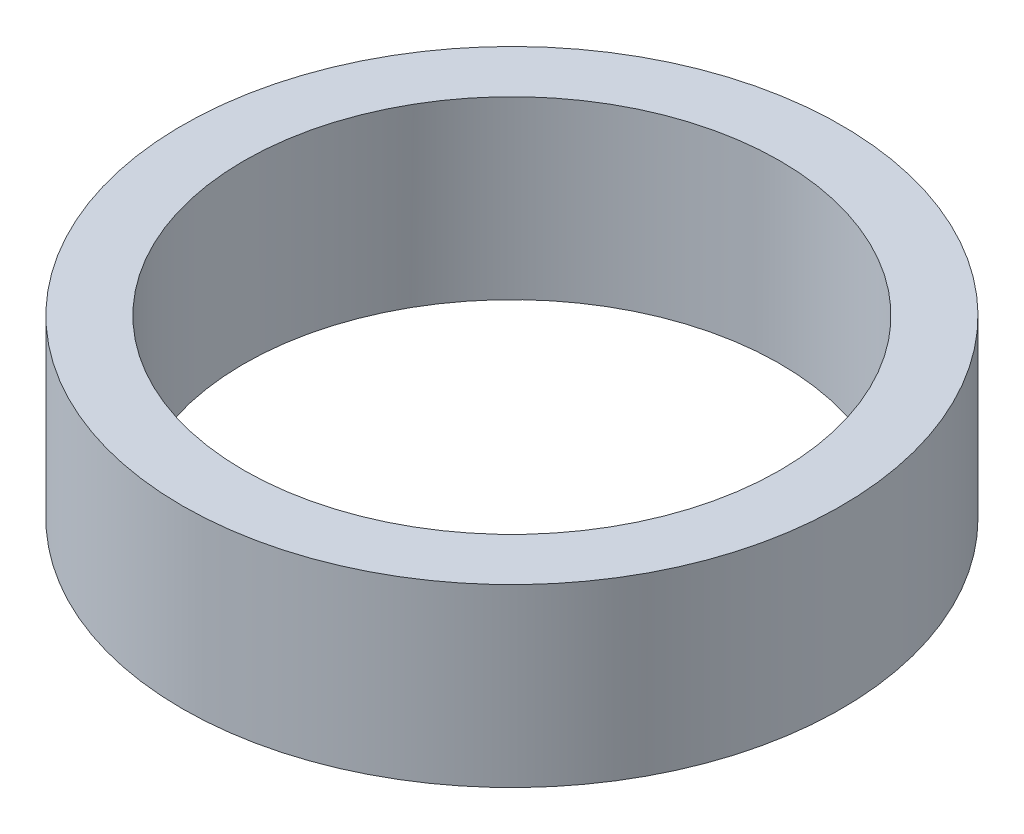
ISO-10303-21;
HEADER;
FILE_DESCRIPTION(('STEP AP214'),'2;1');
FILE_NAME('part.step','',(''),(''),'','','');
FILE_SCHEMA(('AUTOMOTIVE_DESIGN { 1 0 10303 214 1 1 1 1 }'));
ENDSEC;
DATA;
#1=APPLICATION_CONTEXT('core data for automotive mechanical design processes');
#2=APPLICATION_PROTOCOL_DEFINITION('international standard','automotive_design',2000,#1);
#3=PRODUCT_CONTEXT('',#1,'mechanical');
#4=PRODUCT('Part','Part','',(#3));
#5=PRODUCT_RELATED_PRODUCT_CATEGORY('part','',(#4));
#6=PRODUCT_DEFINITION_FORMATION('','',#4);
#7=PRODUCT_DEFINITION_CONTEXT('part definition',#1,'design');
#8=PRODUCT_DEFINITION('design','',#6,#7);
#9=PRODUCT_DEFINITION_SHAPE('','',#8);
#10=(LENGTH_UNIT() NAMED_UNIT(*) SI_UNIT(.MILLI.,.METRE.));
#11=(NAMED_UNIT(*) PLANE_ANGLE_UNIT() SI_UNIT($,.RADIAN.));
#12=(NAMED_UNIT(*) SI_UNIT($,.STERADIAN.) SOLID_ANGLE_UNIT());
#13=UNCERTAINTY_MEASURE_WITH_UNIT(LENGTH_MEASURE(1.E-05),#10,'distance_accuracy_value','');
#14=(GEOMETRIC_REPRESENTATION_CONTEXT(3) GLOBAL_UNCERTAINTY_ASSIGNED_CONTEXT((#13)) GLOBAL_UNIT_ASSIGNED_CONTEXT((#10,
#11,#12)) REPRESENTATION_CONTEXT('',''));
#15=CARTESIAN_POINT('',(0.,0.,0.));
#16=DIRECTION('',(0.,0.,1.));
#17=DIRECTION('',(1.,0.,0.));
#18=AXIS2_PLACEMENT_3D('',#15,#16,#17);
#19=CARTESIAN_POINT('',(0.,-16.0103841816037,0.));
#20=DIRECTION('',(0.,1.,0.));
#21=DIRECTION('',(0.,0.,1.));
#22=AXIS2_PLACEMENT_3D('',#19,#20,#21);
#23=CYLINDRICAL_SURFACE('',#22,4.7625);
#24=CARTESIAN_POINT('',(0.,-2.53999999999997,0.));
#25=DIRECTION('',(0.,1.,0.));
#26=DIRECTION('',(-0.694204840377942,0.,-0.71977749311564));
#27=AXIS2_PLACEMENT_3D('',#24,#25,#26);
#28=CIRCLE('',#27,4.7625);
#29=CARTESIAN_POINT('',(-3.30615055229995,-2.53999999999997,-3.42794031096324));
#30=VERTEX_POINT('',#29);
#31=EDGE_CURVE('E38',#30,#30,#28,.T.);
#32=ORIENTED_EDGE('',*,*,#31,.T.);
#33=EDGE_LOOP('',(#32));
#34=FACE_BOUND('',#33,.T.);
#35=CARTESIAN_POINT('',(0.,0.,0.));
#36=DIRECTION('',(0.,1.,0.));
#37=DIRECTION('',(0.,0.,1.));
#38=AXIS2_PLACEMENT_3D('',#35,#36,#37);
#39=CIRCLE('',#38,4.7625);
#40=CARTESIAN_POINT('',(0.,0.,4.7625));
#41=VERTEX_POINT('',#40);
#42=EDGE_CURVE('E34',#41,#41,#39,.T.);
#43=ORIENTED_EDGE('',*,*,#42,.F.);
#44=EDGE_LOOP('',(#43));
#45=FACE_BOUND('',#44,.T.);
#46=ADVANCED_FACE('F31',(#34,#45),#23,.T.);
#47=CARTESIAN_POINT('',(0.,0.,0.));
#48=DIRECTION('',(0.,1.,0.));
#49=DIRECTION('',(0.,0.,1.));
#50=AXIS2_PLACEMENT_3D('',#47,#48,#49);
#51=PLANE('',#50);
#52=CARTESIAN_POINT('',(0.,0.,0.));
#53=DIRECTION('',(0.,1.,0.));
#54=DIRECTION('',(0.,0.,1.));
#55=AXIS2_PLACEMENT_3D('',#52,#53,#54);
#56=CIRCLE('',#55,3.8735);
#57=CARTESIAN_POINT('',(0.,0.,3.8735));
#58=VERTEX_POINT('',#57);
#59=EDGE_CURVE('E44',#58,#58,#56,.T.);
#60=ORIENTED_EDGE('',*,*,#59,.F.);
#61=EDGE_LOOP('',(#60));
#62=FACE_BOUND('',#61,.T.);
#63=ORIENTED_EDGE('',*,*,#42,.T.);
#64=EDGE_LOOP('',(#63));
#65=FACE_BOUND('',#64,.T.);
#66=ADVANCED_FACE('F51',(#62,#65),#51,.T.);
#67=CARTESIAN_POINT('',(0.,-16.0103841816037,0.));
#68=DIRECTION('',(0.,1.,0.));
#69=DIRECTION('',(0.,0.,1.));
#70=AXIS2_PLACEMENT_3D('',#67,#68,#69);
#71=CYLINDRICAL_SURFACE('',#70,3.8735);
#72=CARTESIAN_POINT('',(0.,-2.53999999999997,0.));
#73=DIRECTION('',(0.,-1.,0.));
#74=DIRECTION('',(0.694204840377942,0.,0.71977749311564));
#75=AXIS2_PLACEMENT_3D('',#72,#73,#74);
#76=CIRCLE('',#75,3.8735);
#77=CARTESIAN_POINT('',(2.68900244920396,-2.53999999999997,2.78805811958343));
#78=VERTEX_POINT('',#77);
#79=EDGE_CURVE('E10',#78,#78,#76,.T.);
#80=ORIENTED_EDGE('',*,*,#79,.T.);
#81=EDGE_LOOP('',(#80));
#82=FACE_BOUND('',#81,.T.);
#83=ORIENTED_EDGE('',*,*,#59,.T.);
#84=EDGE_LOOP('',(#83));
#85=FACE_BOUND('',#84,.T.);
#86=ADVANCED_FACE('F59',(#82,#85),#71,.F.);
#87=CARTESIAN_POINT('',(1.65307527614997,-2.53999999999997,1.71397015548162));
#88=DIRECTION('',(0.,1.,0.));
#89=DIRECTION('',(-0.694204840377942,0.,-0.71977749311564));
#90=AXIS2_PLACEMENT_3D('',#87,#88,#89);
#91=PLANE('',#90);
#92=ORIENTED_EDGE('',*,*,#31,.F.);
#93=EDGE_LOOP('',(#92));
#94=FACE_BOUND('',#93,.T.);
#95=ORIENTED_EDGE('',*,*,#79,.F.);
#96=EDGE_LOOP('',(#95));
#97=FACE_BOUND('',#96,.T.);
#98=ADVANCED_FACE('F63',(#94,#97),#91,.F.);
#99=CLOSED_SHELL('',(#46,#66,#86,#98));
#100=MANIFOLD_SOLID_BREP('B2',#99);
#101=ADVANCED_BREP_SHAPE_REPRESENTATION('',(#18,#100),#14);
#102=SHAPE_DEFINITION_REPRESENTATION(#9,#101);
ENDSEC;
END-ISO-10303-21;
